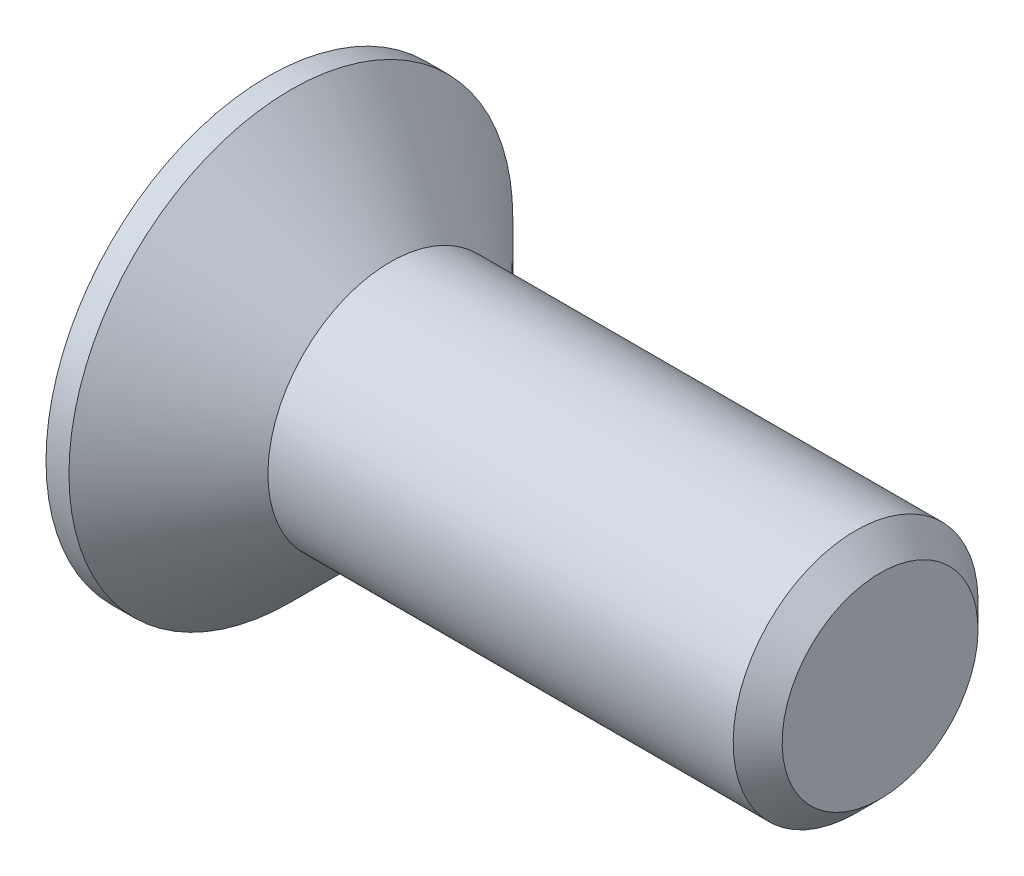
from build123d import *

# Parameters (mm, degrees)
CHAMFER1_SIZE      = 0.8
CUT_EXTRUDE1_DEPTH = 3.45


with BuildPart() as part:
    # Sketch1 → Revolve1 (revolve)
    with BuildSketch(Plane.XY, mode=Mode.PRIVATE) as revolve1_sk:
        Polygon((-4, 7.25), (-4, 0), (16, 0), (16, 4), (0, 4), (-3.25, 7.25), align=None)
    revolve(revolve1_sk.sketch.rotate(Axis((-4, 0, 0), (1, 0, 0)), 180), axis=Axis((-4, 0, 0), (1, 0, 0)))

    # Chamfer1
    chamfer1_edges = [part.edges().sort_by_distance(p)[0] for p in [
        (16, 4, 0),
    ]]
    chamfer(chamfer1_edges, length=CHAMFER1_SIZE)

    # Sketch2 → Cut-Extrude1 (cut)
    with BuildSketch(Plane.ZY.offset(4)):
        Polygon((-1.09, 4.35), (1.09, 4.35), (1.09, 1.09), (4.35, 1.09), (4.35, -1.09), (1.09, -1.09), (1.09, -4.35), (-1.09, -4.35), (-1.09, -1.09), (-4.35, -1.09), (-4.35, 1.09), (-1.09, 1.09), align=None)
    extrude(amount=-CUT_EXTRUDE1_DEPTH, mode=Mode.SUBTRACT)


solid = part.part
